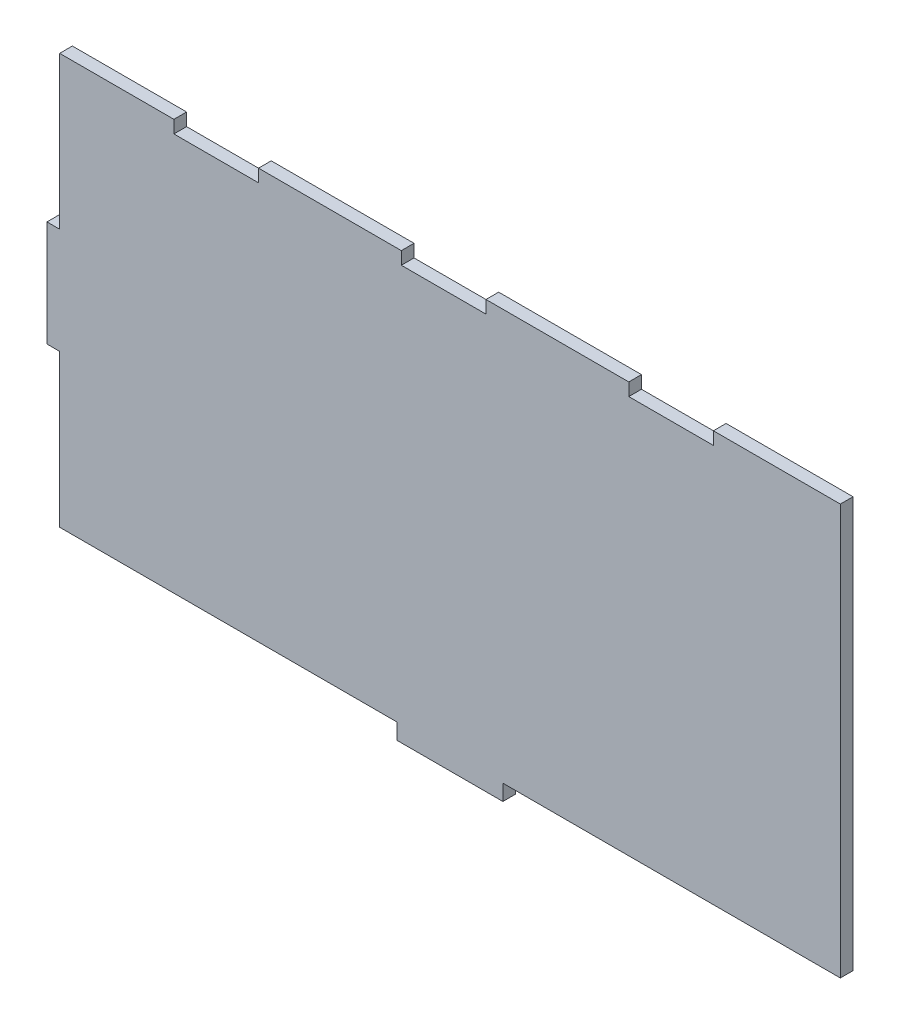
ISO-10303-21;
HEADER;
FILE_DESCRIPTION(('STEP AP214'),'2;1');
FILE_NAME('part.step','',(''),(''),'','','');
FILE_SCHEMA(('AUTOMOTIVE_DESIGN { 1 0 10303 214 1 1 1 1 }'));
ENDSEC;
DATA;
#1=APPLICATION_CONTEXT('core data for automotive mechanical design processes');
#2=APPLICATION_PROTOCOL_DEFINITION('international standard','automotive_design',2000,#1);
#3=PRODUCT_CONTEXT('',#1,'mechanical');
#4=PRODUCT('Part','Part','',(#3));
#5=PRODUCT_RELATED_PRODUCT_CATEGORY('part','',(#4));
#6=PRODUCT_DEFINITION_FORMATION('','',#4);
#7=PRODUCT_DEFINITION_CONTEXT('part definition',#1,'design');
#8=PRODUCT_DEFINITION('design','',#6,#7);
#9=PRODUCT_DEFINITION_SHAPE('','',#8);
#10=(LENGTH_UNIT() NAMED_UNIT(*) SI_UNIT(.MILLI.,.METRE.));
#11=(NAMED_UNIT(*) PLANE_ANGLE_UNIT() SI_UNIT($,.RADIAN.));
#12=(NAMED_UNIT(*) SI_UNIT($,.STERADIAN.) SOLID_ANGLE_UNIT());
#13=UNCERTAINTY_MEASURE_WITH_UNIT(LENGTH_MEASURE(1.E-05),#10,'distance_accuracy_value','');
#14=(GEOMETRIC_REPRESENTATION_CONTEXT(3) GLOBAL_UNCERTAINTY_ASSIGNED_CONTEXT((#13)) GLOBAL_UNIT_ASSIGNED_CONTEXT((#10,
#11,#12)) REPRESENTATION_CONTEXT('',''));
#15=CARTESIAN_POINT('',(0.,0.,0.));
#16=DIRECTION('',(0.,0.,1.));
#17=DIRECTION('',(1.,0.,0.));
#18=AXIS2_PLACEMENT_3D('',#15,#16,#17);
#19=CARTESIAN_POINT('',(-369.,50.,12.));
#20=DIRECTION('',(1.,0.,0.));
#21=DIRECTION('',(0.,0.,-1.));
#22=AXIS2_PLACEMENT_3D('',#19,#20,#21);
#23=PLANE('',#22);
#24=DIRECTION('',(0.,-1.,0.));
#25=VECTOR('',#24,1.);
#26=CARTESIAN_POINT('',(-369.,50.,0.));
#27=LINE('',#26,#25);
#28=CARTESIAN_POINT('',(-369.,194.,0.));
#29=VERTEX_POINT('',#28);
#30=CARTESIAN_POINT('',(-369.,50.,0.));
#31=VERTEX_POINT('',#30);
#32=EDGE_CURVE('E233',#29,#31,#27,.T.);
#33=ORIENTED_EDGE('',*,*,#32,.T.);
#34=DIRECTION('',(0.,0.,-1.));
#35=VECTOR('',#34,1.);
#36=CARTESIAN_POINT('',(-369.,50.,12.));
#37=LINE('',#36,#35);
#38=CARTESIAN_POINT('',(-369.,50.,12.));
#39=VERTEX_POINT('',#38);
#40=EDGE_CURVE('E11',#39,#31,#37,.T.);
#41=ORIENTED_EDGE('',*,*,#40,.F.);
#42=DIRECTION('',(0.,-1.,0.));
#43=VECTOR('',#42,1.);
#44=CARTESIAN_POINT('',(-369.,50.,12.));
#45=LINE('',#44,#43);
#46=CARTESIAN_POINT('',(-369.,194.,12.));
#47=VERTEX_POINT('',#46);
#48=EDGE_CURVE('E280',#47,#39,#45,.T.);
#49=ORIENTED_EDGE('',*,*,#48,.F.);
#50=DIRECTION('',(0.,0.,-1.));
#51=VECTOR('',#50,1.);
#52=CARTESIAN_POINT('',(-369.,194.,12.));
#53=LINE('',#52,#51);
#54=EDGE_CURVE('E229',#47,#29,#53,.T.);
#55=ORIENTED_EDGE('',*,*,#54,.T.);
#56=EDGE_LOOP('',(#33,#41,#49,#55));
#57=FACE_BOUND('',#56,.T.);
#58=ADVANCED_FACE('F39',(#57),#23,.F.);
#59=CARTESIAN_POINT('',(-369.,50.,12.));
#60=DIRECTION('',(0.,-1.,0.));
#61=DIRECTION('',(1.,0.,0.));
#62=AXIS2_PLACEMENT_3D('',#59,#60,#61);
#63=PLANE('',#62);
#64=DIRECTION('',(-1.,0.,0.));
#65=VECTOR('',#64,1.);
#66=CARTESIAN_POINT('',(-369.,50.,0.));
#67=LINE('',#66,#65);
#68=CARTESIAN_POINT('',(-381.,50.,0.));
#69=VERTEX_POINT('',#68);
#70=EDGE_CURVE('E235',#31,#69,#67,.T.);
#71=ORIENTED_EDGE('',*,*,#70,.T.);
#72=DIRECTION('',(0.,0.,-1.));
#73=VECTOR('',#72,1.);
#74=CARTESIAN_POINT('',(-381.,50.,12.));
#75=LINE('',#74,#73);
#76=CARTESIAN_POINT('',(-381.,50.,12.));
#77=VERTEX_POINT('',#76);
#78=EDGE_CURVE('E50',#77,#69,#75,.T.);
#79=ORIENTED_EDGE('',*,*,#78,.F.);
#80=DIRECTION('',(-1.,0.,0.));
#81=VECTOR('',#80,1.);
#82=CARTESIAN_POINT('',(-369.,50.,12.));
#83=LINE('',#82,#81);
#84=EDGE_CURVE('E148',#39,#77,#83,.T.);
#85=ORIENTED_EDGE('',*,*,#84,.F.);
#86=ORIENTED_EDGE('',*,*,#40,.T.);
#87=EDGE_LOOP('',(#71,#79,#85,#86));
#88=FACE_BOUND('',#87,.T.);
#89=ADVANCED_FACE('F411',(#88),#63,.F.);
#90=CARTESIAN_POINT('',(-381.,50.,12.));
#91=DIRECTION('',(1.,0.,0.));
#92=DIRECTION('',(0.,0.,-1.));
#93=AXIS2_PLACEMENT_3D('',#90,#91,#92);
#94=PLANE('',#93);
#95=DIRECTION('',(0.,-1.,0.));
#96=VECTOR('',#95,1.);
#97=CARTESIAN_POINT('',(-381.,50.,0.));
#98=LINE('',#97,#96);
#99=CARTESIAN_POINT('',(-381.,-50.,0.));
#100=VERTEX_POINT('',#99);
#101=EDGE_CURVE('E237',#69,#100,#98,.T.);
#102=ORIENTED_EDGE('',*,*,#101,.T.);
#103=DIRECTION('',(0.,0.,-1.));
#104=VECTOR('',#103,1.);
#105=CARTESIAN_POINT('',(-381.,-50.,12.));
#106=LINE('',#105,#104);
#107=CARTESIAN_POINT('',(-381.,-50.,12.));
#108=VERTEX_POINT('',#107);
#109=EDGE_CURVE('E335',#108,#100,#106,.T.);
#110=ORIENTED_EDGE('',*,*,#109,.F.);
#111=DIRECTION('',(0.,-1.,0.));
#112=VECTOR('',#111,1.);
#113=CARTESIAN_POINT('',(-381.,50.,12.));
#114=LINE('',#113,#112);
#115=EDGE_CURVE('E336',#77,#108,#114,.T.);
#116=ORIENTED_EDGE('',*,*,#115,.F.);
#117=ORIENTED_EDGE('',*,*,#78,.T.);
#118=EDGE_LOOP('',(#102,#110,#116,#117));
#119=FACE_BOUND('',#118,.T.);
#120=ADVANCED_FACE('F337',(#119),#94,.F.);
#121=CARTESIAN_POINT('',(-369.,-50.,12.));
#122=DIRECTION('',(0.,1.,0.));
#123=DIRECTION('',(-1.,0.,0.));
#124=AXIS2_PLACEMENT_3D('',#121,#122,#123);
#125=PLANE('',#124);
#126=DIRECTION('',(1.,0.,0.));
#127=VECTOR('',#126,1.);
#128=CARTESIAN_POINT('',(-369.,-50.,0.));
#129=LINE('',#128,#127);
#130=CARTESIAN_POINT('',(-369.,-50.,0.));
#131=VERTEX_POINT('',#130);
#132=EDGE_CURVE('E236',#100,#131,#129,.T.);
#133=ORIENTED_EDGE('',*,*,#132,.T.);
#134=DIRECTION('',(0.,0.,-1.));
#135=VECTOR('',#134,1.);
#136=CARTESIAN_POINT('',(-369.,-50.,12.));
#137=LINE('',#136,#135);
#138=CARTESIAN_POINT('',(-369.,-50.,12.));
#139=VERTEX_POINT('',#138);
#140=EDGE_CURVE('E328',#139,#131,#137,.T.);
#141=ORIENTED_EDGE('',*,*,#140,.F.);
#142=DIRECTION('',(1.,0.,0.));
#143=VECTOR('',#142,1.);
#144=CARTESIAN_POINT('',(-369.,-50.,12.));
#145=LINE('',#144,#143);
#146=EDGE_CURVE('E357',#108,#139,#145,.T.);
#147=ORIENTED_EDGE('',*,*,#146,.F.);
#148=ORIENTED_EDGE('',*,*,#109,.T.);
#149=EDGE_LOOP('',(#133,#141,#147,#148));
#150=FACE_BOUND('',#149,.T.);
#151=ADVANCED_FACE('F349',(#150),#125,.F.);
#152=CARTESIAN_POINT('',(-369.,-194.,12.));
#153=DIRECTION('',(1.,0.,0.));
#154=DIRECTION('',(0.,1.,0.));
#155=AXIS2_PLACEMENT_3D('',#152,#153,#154);
#156=PLANE('',#155);
#157=DIRECTION('',(0.,-1.,0.));
#158=VECTOR('',#157,1.);
#159=CARTESIAN_POINT('',(-369.,-194.,0.));
#160=LINE('',#159,#158);
#161=CARTESIAN_POINT('',(-369.,-194.,0.));
#162=VERTEX_POINT('',#161);
#163=EDGE_CURVE('E238',#131,#162,#160,.T.);
#164=ORIENTED_EDGE('',*,*,#163,.T.);
#165=DIRECTION('',(0.,0.,-1.));
#166=VECTOR('',#165,1.);
#167=CARTESIAN_POINT('',(-369.,-194.,12.));
#168=LINE('',#167,#166);
#169=CARTESIAN_POINT('',(-369.,-194.,12.));
#170=VERTEX_POINT('',#169);
#171=EDGE_CURVE('E326',#170,#162,#168,.T.);
#172=ORIENTED_EDGE('',*,*,#171,.F.);
#173=DIRECTION('',(0.,-1.,0.));
#174=VECTOR('',#173,1.);
#175=CARTESIAN_POINT('',(-369.,-194.,12.));
#176=LINE('',#175,#174);
#177=EDGE_CURVE('E351',#139,#170,#176,.T.);
#178=ORIENTED_EDGE('',*,*,#177,.F.);
#179=ORIENTED_EDGE('',*,*,#140,.T.);
#180=EDGE_LOOP('',(#164,#172,#178,#179));
#181=FACE_BOUND('',#180,.T.);
#182=ADVANCED_FACE('F352',(#181),#156,.F.);
#183=CARTESIAN_POINT('',(-50.0000000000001,-194.,12.));
#184=DIRECTION('',(0.,1.,0.));
#185=DIRECTION('',(-1.,0.,0.));
#186=AXIS2_PLACEMENT_3D('',#183,#184,#185);
#187=PLANE('',#186);
#188=DIRECTION('',(1.,0.,0.));
#189=VECTOR('',#188,1.);
#190=CARTESIAN_POINT('',(-50.0000000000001,-194.,0.));
#191=LINE('',#190,#189);
#192=CARTESIAN_POINT('',(-50.0000000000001,-194.,0.));
#193=VERTEX_POINT('',#192);
#194=EDGE_CURVE('E244',#162,#193,#191,.T.);
#195=ORIENTED_EDGE('',*,*,#194,.T.);
#196=DIRECTION('',(0.,0.,-1.));
#197=VECTOR('',#196,1.);
#198=CARTESIAN_POINT('',(-50.0000000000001,-194.,12.));
#199=LINE('',#198,#197);
#200=CARTESIAN_POINT('',(-50.0000000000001,-194.,12.));
#201=VERTEX_POINT('',#200);
#202=EDGE_CURVE('E323',#201,#193,#199,.T.);
#203=ORIENTED_EDGE('',*,*,#202,.F.);
#204=DIRECTION('',(1.,0.,0.));
#205=VECTOR('',#204,1.);
#206=CARTESIAN_POINT('',(-50.0000000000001,-194.,12.));
#207=LINE('',#206,#205);
#208=EDGE_CURVE('E359',#170,#201,#207,.T.);
#209=ORIENTED_EDGE('',*,*,#208,.F.);
#210=ORIENTED_EDGE('',*,*,#171,.T.);
#211=EDGE_LOOP('',(#195,#203,#209,#210));
#212=FACE_BOUND('',#211,.T.);
#213=ADVANCED_FACE('F428',(#212),#187,.F.);
#214=CARTESIAN_POINT('',(-50.0000000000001,-194.,12.));
#215=DIRECTION('',(1.,0.,0.));
#216=DIRECTION('',(0.,0.,-1.));
#217=AXIS2_PLACEMENT_3D('',#214,#215,#216);
#218=PLANE('',#217);
#219=DIRECTION('',(0.,-1.,0.));
#220=VECTOR('',#219,1.);
#221=CARTESIAN_POINT('',(-50.0000000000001,-194.,0.));
#222=LINE('',#221,#220);
#223=CARTESIAN_POINT('',(-50.0000000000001,-209.,0.));
#224=VERTEX_POINT('',#223);
#225=EDGE_CURVE('E245',#193,#224,#222,.T.);
#226=ORIENTED_EDGE('',*,*,#225,.T.);
#227=DIRECTION('',(0.,0.,-1.));
#228=VECTOR('',#227,1.);
#229=CARTESIAN_POINT('',(-50.0000000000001,-209.,12.));
#230=LINE('',#229,#228);
#231=CARTESIAN_POINT('',(-50.0000000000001,-209.,12.));
#232=VERTEX_POINT('',#231);
#233=EDGE_CURVE('E319',#232,#224,#230,.T.);
#234=ORIENTED_EDGE('',*,*,#233,.F.);
#235=DIRECTION('',(0.,-1.,0.));
#236=VECTOR('',#235,1.);
#237=CARTESIAN_POINT('',(-50.0000000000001,-194.,12.));
#238=LINE('',#237,#236);
#239=EDGE_CURVE('E356',#201,#232,#238,.T.);
#240=ORIENTED_EDGE('',*,*,#239,.F.);
#241=ORIENTED_EDGE('',*,*,#202,.T.);
#242=EDGE_LOOP('',(#226,#234,#240,#241));
#243=FACE_BOUND('',#242,.T.);
#244=ADVANCED_FACE('F431',(#243),#218,.F.);
#245=CARTESIAN_POINT('',(49.9999999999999,-209.,12.));
#246=DIRECTION('',(0.,1.,0.));
#247=DIRECTION('',(0.,0.,1.));
#248=AXIS2_PLACEMENT_3D('',#245,#246,#247);
#249=PLANE('',#248);
#250=DIRECTION('',(1.,0.,0.));
#251=VECTOR('',#250,1.);
#252=CARTESIAN_POINT('',(49.9999999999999,-209.,0.));
#253=LINE('',#252,#251);
#254=CARTESIAN_POINT('',(49.9999999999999,-209.,0.));
#255=VERTEX_POINT('',#254);
#256=EDGE_CURVE('E248',#224,#255,#253,.T.);
#257=ORIENTED_EDGE('',*,*,#256,.T.);
#258=DIRECTION('',(0.,0.,-1.));
#259=VECTOR('',#258,1.);
#260=CARTESIAN_POINT('',(49.9999999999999,-209.,12.));
#261=LINE('',#260,#259);
#262=CARTESIAN_POINT('',(49.9999999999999,-209.,12.));
#263=VERTEX_POINT('',#262);
#264=EDGE_CURVE('E320',#263,#255,#261,.T.);
#265=ORIENTED_EDGE('',*,*,#264,.F.);
#266=DIRECTION('',(1.,0.,0.));
#267=VECTOR('',#266,1.);
#268=CARTESIAN_POINT('',(49.9999999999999,-209.,12.));
#269=LINE('',#268,#267);
#270=EDGE_CURVE('E368',#232,#263,#269,.T.);
#271=ORIENTED_EDGE('',*,*,#270,.F.);
#272=ORIENTED_EDGE('',*,*,#233,.T.);
#273=EDGE_LOOP('',(#257,#265,#271,#272));
#274=FACE_BOUND('',#273,.T.);
#275=ADVANCED_FACE('F434',(#274),#249,.F.);
#276=CARTESIAN_POINT('',(49.9999999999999,-194.,12.));
#277=DIRECTION('',(-1.,0.,0.));
#278=DIRECTION('',(0.,-1.,0.));
#279=AXIS2_PLACEMENT_3D('',#276,#277,#278);
#280=PLANE('',#279);
#281=DIRECTION('',(0.,1.,0.));
#282=VECTOR('',#281,1.);
#283=CARTESIAN_POINT('',(49.9999999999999,-194.,0.));
#284=LINE('',#283,#282);
#285=CARTESIAN_POINT('',(49.9999999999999,-194.,0.));
#286=VERTEX_POINT('',#285);
#287=EDGE_CURVE('E247',#255,#286,#284,.T.);
#288=ORIENTED_EDGE('',*,*,#287,.T.);
#289=DIRECTION('',(0.,0.,-1.));
#290=VECTOR('',#289,1.);
#291=CARTESIAN_POINT('',(49.9999999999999,-194.,12.));
#292=LINE('',#291,#290);
#293=CARTESIAN_POINT('',(49.9999999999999,-194.,12.));
#294=VERTEX_POINT('',#293);
#295=EDGE_CURVE('E314',#294,#286,#292,.T.);
#296=ORIENTED_EDGE('',*,*,#295,.F.);
#297=DIRECTION('',(0.,1.,0.));
#298=VECTOR('',#297,1.);
#299=CARTESIAN_POINT('',(49.9999999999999,-194.,12.));
#300=LINE('',#299,#298);
#301=EDGE_CURVE('E366',#263,#294,#300,.T.);
#302=ORIENTED_EDGE('',*,*,#301,.F.);
#303=ORIENTED_EDGE('',*,*,#264,.T.);
#304=EDGE_LOOP('',(#288,#296,#302,#303));
#305=FACE_BOUND('',#304,.T.);
#306=ADVANCED_FACE('F438',(#305),#280,.F.);
#307=CARTESIAN_POINT('',(369.,-194.,12.));
#308=DIRECTION('',(0.,1.,0.));
#309=DIRECTION('',(-1.,0.,0.));
#310=AXIS2_PLACEMENT_3D('',#307,#308,#309);
#311=PLANE('',#310);
#312=DIRECTION('',(1.,0.,0.));
#313=VECTOR('',#312,1.);
#314=CARTESIAN_POINT('',(369.,-194.,0.));
#315=LINE('',#314,#313);
#316=CARTESIAN_POINT('',(369.,-194.,0.));
#317=VERTEX_POINT('',#316);
#318=EDGE_CURVE('E246',#286,#317,#315,.T.);
#319=ORIENTED_EDGE('',*,*,#318,.T.);
#320=DIRECTION('',(0.,0.,-1.));
#321=VECTOR('',#320,1.);
#322=CARTESIAN_POINT('',(369.,-194.,12.));
#323=LINE('',#322,#321);
#324=CARTESIAN_POINT('',(369.,-194.,12.));
#325=VERTEX_POINT('',#324);
#326=EDGE_CURVE('E313',#325,#317,#323,.T.);
#327=ORIENTED_EDGE('',*,*,#326,.F.);
#328=DIRECTION('',(1.,0.,0.));
#329=VECTOR('',#328,1.);
#330=CARTESIAN_POINT('',(369.,-194.,12.));
#331=LINE('',#330,#329);
#332=EDGE_CURVE('E367',#294,#325,#331,.T.);
#333=ORIENTED_EDGE('',*,*,#332,.F.);
#334=ORIENTED_EDGE('',*,*,#295,.T.);
#335=EDGE_LOOP('',(#319,#327,#333,#334));
#336=FACE_BOUND('',#335,.T.);
#337=ADVANCED_FACE('F444',(#336),#311,.F.);
#338=CARTESIAN_POINT('',(369.,-194.,12.));
#339=DIRECTION('',(-1.,0.,0.));
#340=DIRECTION('',(0.,0.,1.));
#341=AXIS2_PLACEMENT_3D('',#338,#339,#340);
#342=PLANE('',#341);
#343=DIRECTION('',(0.,1.,0.));
#344=VECTOR('',#343,1.);
#345=CARTESIAN_POINT('',(369.,-194.,0.));
#346=LINE('',#345,#344);
#347=CARTESIAN_POINT('',(369.,194.,0.));
#348=VERTEX_POINT('',#347);
#349=EDGE_CURVE('E252',#317,#348,#346,.T.);
#350=ORIENTED_EDGE('',*,*,#349,.T.);
#351=DIRECTION('',(0.,0.,-1.));
#352=VECTOR('',#351,1.);
#353=CARTESIAN_POINT('',(369.,194.,12.));
#354=LINE('',#353,#352);
#355=CARTESIAN_POINT('',(369.,194.,12.));
#356=VERTEX_POINT('',#355);
#357=EDGE_CURVE('E306',#356,#348,#354,.T.);
#358=ORIENTED_EDGE('',*,*,#357,.F.);
#359=DIRECTION('',(0.,1.,0.));
#360=VECTOR('',#359,1.);
#361=CARTESIAN_POINT('',(369.,-194.,12.));
#362=LINE('',#361,#360);
#363=EDGE_CURVE('E375',#325,#356,#362,.T.);
#364=ORIENTED_EDGE('',*,*,#363,.F.);
#365=ORIENTED_EDGE('',*,*,#326,.T.);
#366=EDGE_LOOP('',(#350,#358,#364,#365));
#367=FACE_BOUND('',#366,.T.);
#368=ADVANCED_FACE('F449',(#367),#342,.F.);
#369=CARTESIAN_POINT('',(369.,194.,12.));
#370=DIRECTION('',(0.,-1.,0.));
#371=DIRECTION('',(1.,0.,0.));
#372=AXIS2_PLACEMENT_3D('',#369,#370,#371);
#373=PLANE('',#372);
#374=DIRECTION('',(-1.,0.,0.));
#375=VECTOR('',#374,1.);
#376=CARTESIAN_POINT('',(369.,194.,0.));
#377=LINE('',#376,#375);
#378=CARTESIAN_POINT('',(249.,194.,0.));
#379=VERTEX_POINT('',#378);
#380=EDGE_CURVE('E255',#348,#379,#377,.T.);
#381=ORIENTED_EDGE('',*,*,#380,.T.);
#382=DIRECTION('',(0.,0.,-1.));
#383=VECTOR('',#382,1.);
#384=CARTESIAN_POINT('',(249.,194.,12.));
#385=LINE('',#384,#383);
#386=CARTESIAN_POINT('',(249.,194.,12.));
#387=VERTEX_POINT('',#386);
#388=EDGE_CURVE('E301',#387,#379,#385,.T.);
#389=ORIENTED_EDGE('',*,*,#388,.F.);
#390=DIRECTION('',(-1.,0.,0.));
#391=VECTOR('',#390,1.);
#392=CARTESIAN_POINT('',(369.,194.,12.));
#393=LINE('',#392,#391);
#394=EDGE_CURVE('E372',#356,#387,#393,.T.);
#395=ORIENTED_EDGE('',*,*,#394,.F.);
#396=ORIENTED_EDGE('',*,*,#357,.T.);
#397=EDGE_LOOP('',(#381,#389,#395,#396));
#398=FACE_BOUND('',#397,.T.);
#399=ADVANCED_FACE('F453',(#398),#373,.F.);
#400=CARTESIAN_POINT('',(249.,194.,12.));
#401=DIRECTION('',(1.,0.,0.));
#402=DIRECTION('',(0.,0.,-1.));
#403=AXIS2_PLACEMENT_3D('',#400,#401,#402);
#404=PLANE('',#403);
#405=DIRECTION('',(0.,-1.,0.));
#406=VECTOR('',#405,1.);
#407=CARTESIAN_POINT('',(249.,194.,0.));
#408=LINE('',#407,#406);
#409=CARTESIAN_POINT('',(249.,182.,0.));
#410=VERTEX_POINT('',#409);
#411=EDGE_CURVE('E258',#379,#410,#408,.T.);
#412=ORIENTED_EDGE('',*,*,#411,.T.);
#413=DIRECTION('',(0.,0.,-1.));
#414=VECTOR('',#413,1.);
#415=CARTESIAN_POINT('',(249.,182.,12.));
#416=LINE('',#415,#414);
#417=CARTESIAN_POINT('',(249.,182.,12.));
#418=VERTEX_POINT('',#417);
#419=EDGE_CURVE('E304',#418,#410,#416,.T.);
#420=ORIENTED_EDGE('',*,*,#419,.F.);
#421=DIRECTION('',(0.,-1.,0.));
#422=VECTOR('',#421,1.);
#423=CARTESIAN_POINT('',(249.,194.,12.));
#424=LINE('',#423,#422);
#425=EDGE_CURVE('E376',#387,#418,#424,.T.);
#426=ORIENTED_EDGE('',*,*,#425,.F.);
#427=ORIENTED_EDGE('',*,*,#388,.T.);
#428=EDGE_LOOP('',(#412,#420,#426,#427));
#429=FACE_BOUND('',#428,.T.);
#430=ADVANCED_FACE('F451',(#429),#404,.F.);
#431=CARTESIAN_POINT('',(169.,182.,12.));
#432=DIRECTION('',(0.,-1.,0.));
#433=DIRECTION('',(0.,0.,-1.));
#434=AXIS2_PLACEMENT_3D('',#431,#432,#433);
#435=PLANE('',#434);
#436=DIRECTION('',(-1.,0.,0.));
#437=VECTOR('',#436,1.);
#438=CARTESIAN_POINT('',(169.,182.,0.));
#439=LINE('',#438,#437);
#440=CARTESIAN_POINT('',(169.,182.,0.));
#441=VERTEX_POINT('',#440);
#442=EDGE_CURVE('E256',#410,#441,#439,.T.);
#443=ORIENTED_EDGE('',*,*,#442,.T.);
#444=DIRECTION('',(0.,0.,-1.));
#445=VECTOR('',#444,1.);
#446=CARTESIAN_POINT('',(169.,182.,12.));
#447=LINE('',#446,#445);
#448=CARTESIAN_POINT('',(169.,182.,12.));
#449=VERTEX_POINT('',#448);
#450=EDGE_CURVE('E300',#449,#441,#447,.T.);
#451=ORIENTED_EDGE('',*,*,#450,.F.);
#452=DIRECTION('',(-1.,0.,0.));
#453=VECTOR('',#452,1.);
#454=CARTESIAN_POINT('',(169.,182.,12.));
#455=LINE('',#454,#453);
#456=EDGE_CURVE('E378',#418,#449,#455,.T.);
#457=ORIENTED_EDGE('',*,*,#456,.F.);
#458=ORIENTED_EDGE('',*,*,#419,.T.);
#459=EDGE_LOOP('',(#443,#451,#457,#458));
#460=FACE_BOUND('',#459,.T.);
#461=ADVANCED_FACE('F459',(#460),#435,.F.);
#462=CARTESIAN_POINT('',(169.,194.,12.));
#463=DIRECTION('',(-1.,0.,0.));
#464=DIRECTION('',(0.,0.,1.));
#465=AXIS2_PLACEMENT_3D('',#462,#463,#464);
#466=PLANE('',#465);
#467=DIRECTION('',(0.,1.,0.));
#468=VECTOR('',#467,1.);
#469=CARTESIAN_POINT('',(169.,194.,0.));
#470=LINE('',#469,#468);
#471=CARTESIAN_POINT('',(169.,194.,0.));
#472=VERTEX_POINT('',#471);
#473=EDGE_CURVE('E257',#441,#472,#470,.T.);
#474=ORIENTED_EDGE('',*,*,#473,.T.);
#475=DIRECTION('',(0.,0.,-1.));
#476=VECTOR('',#475,1.);
#477=CARTESIAN_POINT('',(169.,194.,12.));
#478=LINE('',#477,#476);
#479=CARTESIAN_POINT('',(169.,194.,12.));
#480=VERTEX_POINT('',#479);
#481=EDGE_CURVE('E298',#480,#472,#478,.T.);
#482=ORIENTED_EDGE('',*,*,#481,.F.);
#483=DIRECTION('',(0.,1.,0.));
#484=VECTOR('',#483,1.);
#485=CARTESIAN_POINT('',(169.,194.,12.));
#486=LINE('',#485,#484);
#487=EDGE_CURVE('E379',#449,#480,#486,.T.);
#488=ORIENTED_EDGE('',*,*,#487,.F.);
#489=ORIENTED_EDGE('',*,*,#450,.T.);
#490=EDGE_LOOP('',(#474,#482,#488,#489));
#491=FACE_BOUND('',#490,.T.);
#492=ADVANCED_FACE('F462',(#491),#466,.F.);
#493=CARTESIAN_POINT('',(169.,194.,12.));
#494=DIRECTION('',(0.,-1.,0.));
#495=DIRECTION('',(1.,0.,0.));
#496=AXIS2_PLACEMENT_3D('',#493,#494,#495);
#497=PLANE('',#496);
#498=DIRECTION('',(-1.,0.,0.));
#499=VECTOR('',#498,1.);
#500=CARTESIAN_POINT('',(169.,194.,0.));
#501=LINE('',#500,#499);
#502=CARTESIAN_POINT('',(33.9999999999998,194.,0.));
#503=VERTEX_POINT('',#502);
#504=EDGE_CURVE('E265',#472,#503,#501,.T.);
#505=ORIENTED_EDGE('',*,*,#504,.T.);
#506=DIRECTION('',(0.,0.,-1.));
#507=VECTOR('',#506,1.);
#508=CARTESIAN_POINT('',(33.9999999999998,194.,12.));
#509=LINE('',#508,#507);
#510=CARTESIAN_POINT('',(33.9999999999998,194.,12.));
#511=VERTEX_POINT('',#510);
#512=EDGE_CURVE('E291',#511,#503,#509,.T.);
#513=ORIENTED_EDGE('',*,*,#512,.F.);
#514=DIRECTION('',(-1.,0.,0.));
#515=VECTOR('',#514,1.);
#516=CARTESIAN_POINT('',(169.,194.,12.));
#517=LINE('',#516,#515);
#518=EDGE_CURVE('E385',#480,#511,#517,.T.);
#519=ORIENTED_EDGE('',*,*,#518,.F.);
#520=ORIENTED_EDGE('',*,*,#481,.T.);
#521=EDGE_LOOP('',(#505,#513,#519,#520));
#522=FACE_BOUND('',#521,.T.);
#523=ADVANCED_FACE('F469',(#522),#497,.F.);
#524=CARTESIAN_POINT('',(33.9999999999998,194.,12.));
#525=DIRECTION('',(1.,0.,0.));
#526=DIRECTION('',(0.,1.,0.));
#527=AXIS2_PLACEMENT_3D('',#524,#525,#526);
#528=PLANE('',#527);
#529=DIRECTION('',(0.,-1.,0.));
#530=VECTOR('',#529,1.);
#531=CARTESIAN_POINT('',(33.9999999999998,194.,0.));
#532=LINE('',#531,#530);
#533=CARTESIAN_POINT('',(33.9999999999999,182.,0.));
#534=VERTEX_POINT('',#533);
#535=EDGE_CURVE('E262',#503,#534,#532,.T.);
#536=ORIENTED_EDGE('',*,*,#535,.T.);
#537=DIRECTION('',(0.,0.,-1.));
#538=VECTOR('',#537,1.);
#539=CARTESIAN_POINT('',(33.9999999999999,182.,12.));
#540=LINE('',#539,#538);
#541=CARTESIAN_POINT('',(33.9999999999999,182.,12.));
#542=VERTEX_POINT('',#541);
#543=EDGE_CURVE('E286',#542,#534,#540,.T.);
#544=ORIENTED_EDGE('',*,*,#543,.F.);
#545=DIRECTION('',(0.,-1.,0.));
#546=VECTOR('',#545,1.);
#547=CARTESIAN_POINT('',(33.9999999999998,194.,12.));
#548=LINE('',#547,#546);
#549=EDGE_CURVE('E383',#511,#542,#548,.T.);
#550=ORIENTED_EDGE('',*,*,#549,.F.);
#551=ORIENTED_EDGE('',*,*,#512,.T.);
#552=EDGE_LOOP('',(#536,#544,#550,#551));
#553=FACE_BOUND('',#552,.T.);
#554=ADVANCED_FACE('F473',(#553),#528,.F.);
#555=CARTESIAN_POINT('',(-46.0000000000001,182.,12.));
#556=DIRECTION('',(0.,-1.,0.));
#557=DIRECTION('',(0.,0.,-1.));
#558=AXIS2_PLACEMENT_3D('',#555,#556,#557);
#559=PLANE('',#558);
#560=DIRECTION('',(-1.,0.,0.));
#561=VECTOR('',#560,1.);
#562=CARTESIAN_POINT('',(-46.0000000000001,182.,0.));
#563=LINE('',#562,#561);
#564=CARTESIAN_POINT('',(-46.0000000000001,182.,0.));
#565=VERTEX_POINT('',#564);
#566=EDGE_CURVE('E266',#534,#565,#563,.T.);
#567=ORIENTED_EDGE('',*,*,#566,.T.);
#568=DIRECTION('',(0.,0.,-1.));
#569=VECTOR('',#568,1.);
#570=CARTESIAN_POINT('',(-46.0000000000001,182.,12.));
#571=LINE('',#570,#569);
#572=CARTESIAN_POINT('',(-46.0000000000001,182.,12.));
#573=VERTEX_POINT('',#572);
#574=EDGE_CURVE('E289',#573,#565,#571,.T.);
#575=ORIENTED_EDGE('',*,*,#574,.F.);
#576=DIRECTION('',(-1.,0.,0.));
#577=VECTOR('',#576,1.);
#578=CARTESIAN_POINT('',(-46.0000000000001,182.,12.));
#579=LINE('',#578,#577);
#580=EDGE_CURVE('E387',#542,#573,#579,.T.);
#581=ORIENTED_EDGE('',*,*,#580,.F.);
#582=ORIENTED_EDGE('',*,*,#543,.T.);
#583=EDGE_LOOP('',(#567,#575,#581,#582));
#584=FACE_BOUND('',#583,.T.);
#585=ADVANCED_FACE('F474',(#584),#559,.F.);
#586=CARTESIAN_POINT('',(-46.0000000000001,194.,12.));
#587=DIRECTION('',(-1.,0.,0.));
#588=DIRECTION('',(0.,0.,1.));
#589=AXIS2_PLACEMENT_3D('',#586,#587,#588);
#590=PLANE('',#589);
#591=DIRECTION('',(0.,1.,0.));
#592=VECTOR('',#591,1.);
#593=CARTESIAN_POINT('',(-46.0000000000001,194.,0.));
#594=LINE('',#593,#592);
#595=CARTESIAN_POINT('',(-46.0000000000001,194.,0.));
#596=VERTEX_POINT('',#595);
#597=EDGE_CURVE('E268',#565,#596,#594,.T.);
#598=ORIENTED_EDGE('',*,*,#597,.T.);
#599=DIRECTION('',(0.,0.,-1.));
#600=VECTOR('',#599,1.);
#601=CARTESIAN_POINT('',(-46.0000000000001,194.,12.));
#602=LINE('',#601,#600);
#603=CARTESIAN_POINT('',(-46.0000000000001,194.,12.));
#604=VERTEX_POINT('',#603);
#605=EDGE_CURVE('E285',#604,#596,#602,.T.);
#606=ORIENTED_EDGE('',*,*,#605,.F.);
#607=DIRECTION('',(0.,1.,0.));
#608=VECTOR('',#607,1.);
#609=CARTESIAN_POINT('',(-46.0000000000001,194.,12.));
#610=LINE('',#609,#608);
#611=EDGE_CURVE('E389',#573,#604,#610,.T.);
#612=ORIENTED_EDGE('',*,*,#611,.F.);
#613=ORIENTED_EDGE('',*,*,#574,.T.);
#614=EDGE_LOOP('',(#598,#606,#612,#613));
#615=FACE_BOUND('',#614,.T.);
#616=ADVANCED_FACE('F479',(#615),#590,.F.);
#617=CARTESIAN_POINT('',(-46.0000000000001,194.,12.));
#618=DIRECTION('',(0.,-1.,0.));
#619=DIRECTION('',(1.,0.,0.));
#620=AXIS2_PLACEMENT_3D('',#617,#618,#619);
#621=PLANE('',#620);
#622=DIRECTION('',(-1.,0.,0.));
#623=VECTOR('',#622,1.);
#624=CARTESIAN_POINT('',(-46.0000000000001,194.,0.));
#625=LINE('',#624,#623);
#626=CARTESIAN_POINT('',(-181.,194.,0.));
#627=VERTEX_POINT('',#626);
#628=EDGE_CURVE('E269',#596,#627,#625,.T.);
#629=ORIENTED_EDGE('',*,*,#628,.T.);
#630=DIRECTION('',(0.,0.,-1.));
#631=VECTOR('',#630,1.);
#632=CARTESIAN_POINT('',(-181.,194.,12.));
#633=LINE('',#632,#631);
#634=CARTESIAN_POINT('',(-181.,194.,12.));
#635=VERTEX_POINT('',#634);
#636=EDGE_CURVE('E283',#635,#627,#633,.T.);
#637=ORIENTED_EDGE('',*,*,#636,.F.);
#638=DIRECTION('',(-1.,0.,0.));
#639=VECTOR('',#638,1.);
#640=CARTESIAN_POINT('',(-46.0000000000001,194.,12.));
#641=LINE('',#640,#639);
#642=EDGE_CURVE('E388',#604,#635,#641,.T.);
#643=ORIENTED_EDGE('',*,*,#642,.F.);
#644=ORIENTED_EDGE('',*,*,#605,.T.);
#645=EDGE_LOOP('',(#629,#637,#643,#644));
#646=FACE_BOUND('',#645,.T.);
#647=ADVANCED_FACE('F398',(#646),#621,.F.);
#648=CARTESIAN_POINT('',(-181.,194.,12.));
#649=DIRECTION('',(1.,0.,0.));
#650=DIRECTION('',(0.,0.,-1.));
#651=AXIS2_PLACEMENT_3D('',#648,#649,#650);
#652=PLANE('',#651);
#653=DIRECTION('',(0.,-1.,0.));
#654=VECTOR('',#653,1.);
#655=CARTESIAN_POINT('',(-181.,194.,0.));
#656=LINE('',#655,#654);
#657=CARTESIAN_POINT('',(-181.,182.,0.));
#658=VERTEX_POINT('',#657);
#659=EDGE_CURVE('E275',#627,#658,#656,.T.);
#660=ORIENTED_EDGE('',*,*,#659,.T.);
#661=DIRECTION('',(0.,0.,-1.));
#662=VECTOR('',#661,1.);
#663=CARTESIAN_POINT('',(-181.,182.,12.));
#664=LINE('',#663,#662);
#665=CARTESIAN_POINT('',(-181.,182.,12.));
#666=VERTEX_POINT('',#665);
#667=EDGE_CURVE('E225',#666,#658,#664,.T.);
#668=ORIENTED_EDGE('',*,*,#667,.F.);
#669=DIRECTION('',(0.,-1.,0.));
#670=VECTOR('',#669,1.);
#671=CARTESIAN_POINT('',(-181.,194.,12.));
#672=LINE('',#671,#670);
#673=EDGE_CURVE('E213',#635,#666,#672,.T.);
#674=ORIENTED_EDGE('',*,*,#673,.F.);
#675=ORIENTED_EDGE('',*,*,#636,.T.);
#676=EDGE_LOOP('',(#660,#668,#674,#675));
#677=FACE_BOUND('',#676,.T.);
#678=ADVANCED_FACE('F396',(#677),#652,.F.);
#679=CARTESIAN_POINT('',(-261.,182.,12.));
#680=DIRECTION('',(0.,-1.,0.));
#681=DIRECTION('',(0.,0.,-1.));
#682=AXIS2_PLACEMENT_3D('',#679,#680,#681);
#683=PLANE('',#682);
#684=DIRECTION('',(-1.,0.,0.));
#685=VECTOR('',#684,1.);
#686=CARTESIAN_POINT('',(-261.,182.,0.));
#687=LINE('',#686,#685);
#688=CARTESIAN_POINT('',(-261.,182.,0.));
#689=VERTEX_POINT('',#688);
#690=EDGE_CURVE('E222',#658,#689,#687,.T.);
#691=ORIENTED_EDGE('',*,*,#690,.T.);
#692=DIRECTION('',(0.,0.,-1.));
#693=VECTOR('',#692,1.);
#694=CARTESIAN_POINT('',(-261.,182.,12.));
#695=LINE('',#694,#693);
#696=CARTESIAN_POINT('',(-261.,182.,12.));
#697=VERTEX_POINT('',#696);
#698=EDGE_CURVE('E217',#697,#689,#695,.T.);
#699=ORIENTED_EDGE('',*,*,#698,.F.);
#700=DIRECTION('',(-1.,0.,0.));
#701=VECTOR('',#700,1.);
#702=CARTESIAN_POINT('',(-261.,182.,12.));
#703=LINE('',#702,#701);
#704=EDGE_CURVE('E210',#666,#697,#703,.T.);
#705=ORIENTED_EDGE('',*,*,#704,.F.);
#706=ORIENTED_EDGE('',*,*,#667,.T.);
#707=EDGE_LOOP('',(#691,#699,#705,#706));
#708=FACE_BOUND('',#707,.T.);
#709=ADVANCED_FACE('F218',(#708),#683,.F.);
#710=CARTESIAN_POINT('',(-261.,194.,12.));
#711=DIRECTION('',(-1.,0.,0.));
#712=DIRECTION('',(0.,0.,1.));
#713=AXIS2_PLACEMENT_3D('',#710,#711,#712);
#714=PLANE('',#713);
#715=DIRECTION('',(0.,1.,0.));
#716=VECTOR('',#715,1.);
#717=CARTESIAN_POINT('',(-261.,194.,0.));
#718=LINE('',#717,#716);
#719=CARTESIAN_POINT('',(-261.,194.,0.));
#720=VERTEX_POINT('',#719);
#721=EDGE_CURVE('E134',#689,#720,#718,.T.);
#722=ORIENTED_EDGE('',*,*,#721,.T.);
#723=DIRECTION('',(0.,0.,-1.));
#724=VECTOR('',#723,1.);
#725=CARTESIAN_POINT('',(-261.,194.,12.));
#726=LINE('',#725,#724);
#727=CARTESIAN_POINT('',(-261.,194.,12.));
#728=VERTEX_POINT('',#727);
#729=EDGE_CURVE('E224',#728,#720,#726,.T.);
#730=ORIENTED_EDGE('',*,*,#729,.F.);
#731=DIRECTION('',(0.,1.,0.));
#732=VECTOR('',#731,1.);
#733=CARTESIAN_POINT('',(-261.,194.,12.));
#734=LINE('',#733,#732);
#735=EDGE_CURVE('E211',#697,#728,#734,.T.);
#736=ORIENTED_EDGE('',*,*,#735,.F.);
#737=ORIENTED_EDGE('',*,*,#698,.T.);
#738=EDGE_LOOP('',(#722,#730,#736,#737));
#739=FACE_BOUND('',#738,.T.);
#740=ADVANCED_FACE('F223',(#739),#714,.F.);
#741=CARTESIAN_POINT('',(-261.,194.,12.));
#742=DIRECTION('',(0.,-1.,0.));
#743=DIRECTION('',(0.,0.,-1.));
#744=AXIS2_PLACEMENT_3D('',#741,#742,#743);
#745=PLANE('',#744);
#746=DIRECTION('',(-1.,0.,0.));
#747=VECTOR('',#746,1.);
#748=CARTESIAN_POINT('',(-261.,194.,0.));
#749=LINE('',#748,#747);
#750=EDGE_CURVE('E137',#720,#29,#749,.T.);
#751=ORIENTED_EDGE('',*,*,#750,.T.);
#752=ORIENTED_EDGE('',*,*,#54,.F.);
#753=DIRECTION('',(-1.,0.,0.));
#754=VECTOR('',#753,1.);
#755=CARTESIAN_POINT('',(-261.,194.,12.));
#756=LINE('',#755,#754);
#757=EDGE_CURVE('E54',#728,#47,#756,.T.);
#758=ORIENTED_EDGE('',*,*,#757,.F.);
#759=ORIENTED_EDGE('',*,*,#729,.T.);
#760=EDGE_LOOP('',(#751,#752,#758,#759));
#761=FACE_BOUND('',#760,.T.);
#762=ADVANCED_FACE('F404',(#761),#745,.F.);
#763=CARTESIAN_POINT('',(0.,0.,12.));
#764=DIRECTION('',(0.,0.,1.));
#765=DIRECTION('',(1.,0.,0.));
#766=AXIS2_PLACEMENT_3D('',#763,#764,#765);
#767=PLANE('',#766);
#768=ORIENTED_EDGE('',*,*,#48,.T.);
#769=ORIENTED_EDGE('',*,*,#84,.T.);
#770=ORIENTED_EDGE('',*,*,#115,.T.);
#771=ORIENTED_EDGE('',*,*,#146,.T.);
#772=ORIENTED_EDGE('',*,*,#177,.T.);
#773=ORIENTED_EDGE('',*,*,#208,.T.);
#774=ORIENTED_EDGE('',*,*,#239,.T.);
#775=ORIENTED_EDGE('',*,*,#270,.T.);
#776=ORIENTED_EDGE('',*,*,#301,.T.);
#777=ORIENTED_EDGE('',*,*,#332,.T.);
#778=ORIENTED_EDGE('',*,*,#363,.T.);
#779=ORIENTED_EDGE('',*,*,#394,.T.);
#780=ORIENTED_EDGE('',*,*,#425,.T.);
#781=ORIENTED_EDGE('',*,*,#456,.T.);
#782=ORIENTED_EDGE('',*,*,#487,.T.);
#783=ORIENTED_EDGE('',*,*,#518,.T.);
#784=ORIENTED_EDGE('',*,*,#549,.T.);
#785=ORIENTED_EDGE('',*,*,#580,.T.);
#786=ORIENTED_EDGE('',*,*,#611,.T.);
#787=ORIENTED_EDGE('',*,*,#642,.T.);
#788=ORIENTED_EDGE('',*,*,#673,.T.);
#789=ORIENTED_EDGE('',*,*,#704,.T.);
#790=ORIENTED_EDGE('',*,*,#735,.T.);
#791=ORIENTED_EDGE('',*,*,#757,.T.);
#792=EDGE_LOOP('',(#768,#769,#770,#771,#772,#773,#774,#775,#776,#777,#778,#779,#780,#781,#782,
#783,#784,#785,#786,#787,#788,#789,#790,#791));
#793=FACE_BOUND('',#792,.T.);
#794=ADVANCED_FACE('F207',(#793),#767,.T.);
#795=CARTESIAN_POINT('',(0.,0.,0.));
#796=DIRECTION('',(0.,0.,1.));
#797=DIRECTION('',(1.,0.,0.));
#798=AXIS2_PLACEMENT_3D('',#795,#796,#797);
#799=PLANE('',#798);
#800=ORIENTED_EDGE('',*,*,#32,.F.);
#801=ORIENTED_EDGE('',*,*,#750,.F.);
#802=ORIENTED_EDGE('',*,*,#721,.F.);
#803=ORIENTED_EDGE('',*,*,#690,.F.);
#804=ORIENTED_EDGE('',*,*,#659,.F.);
#805=ORIENTED_EDGE('',*,*,#628,.F.);
#806=ORIENTED_EDGE('',*,*,#597,.F.);
#807=ORIENTED_EDGE('',*,*,#566,.F.);
#808=ORIENTED_EDGE('',*,*,#535,.F.);
#809=ORIENTED_EDGE('',*,*,#504,.F.);
#810=ORIENTED_EDGE('',*,*,#473,.F.);
#811=ORIENTED_EDGE('',*,*,#442,.F.);
#812=ORIENTED_EDGE('',*,*,#411,.F.);
#813=ORIENTED_EDGE('',*,*,#380,.F.);
#814=ORIENTED_EDGE('',*,*,#349,.F.);
#815=ORIENTED_EDGE('',*,*,#318,.F.);
#816=ORIENTED_EDGE('',*,*,#287,.F.);
#817=ORIENTED_EDGE('',*,*,#256,.F.);
#818=ORIENTED_EDGE('',*,*,#225,.F.);
#819=ORIENTED_EDGE('',*,*,#194,.F.);
#820=ORIENTED_EDGE('',*,*,#163,.F.);
#821=ORIENTED_EDGE('',*,*,#132,.F.);
#822=ORIENTED_EDGE('',*,*,#101,.F.);
#823=ORIENTED_EDGE('',*,*,#70,.F.);
#824=EDGE_LOOP('',(#800,#801,#802,#803,#804,#805,#806,#807,#808,#809,#810,#811,#812,#813,#814,
#815,#816,#817,#818,#819,#820,#821,#822,#823));
#825=FACE_BOUND('',#824,.T.);
#826=ADVANCED_FACE('F345',(#825),#799,.F.);
#827=CLOSED_SHELL('',(#58,#89,#120,#151,#182,#213,#244,#275,#306,#337,#368,#399,#430,#461,#492,
#523,#554,#585,#616,#647,#678,#709,#740,#762,#794,#826));
#828=MANIFOLD_SOLID_BREP('B2',#827);
#829=ADVANCED_BREP_SHAPE_REPRESENTATION('',(#18,#828),#14);
#830=SHAPE_DEFINITION_REPRESENTATION(#9,#829);
ENDSEC;
END-ISO-10303-21;
